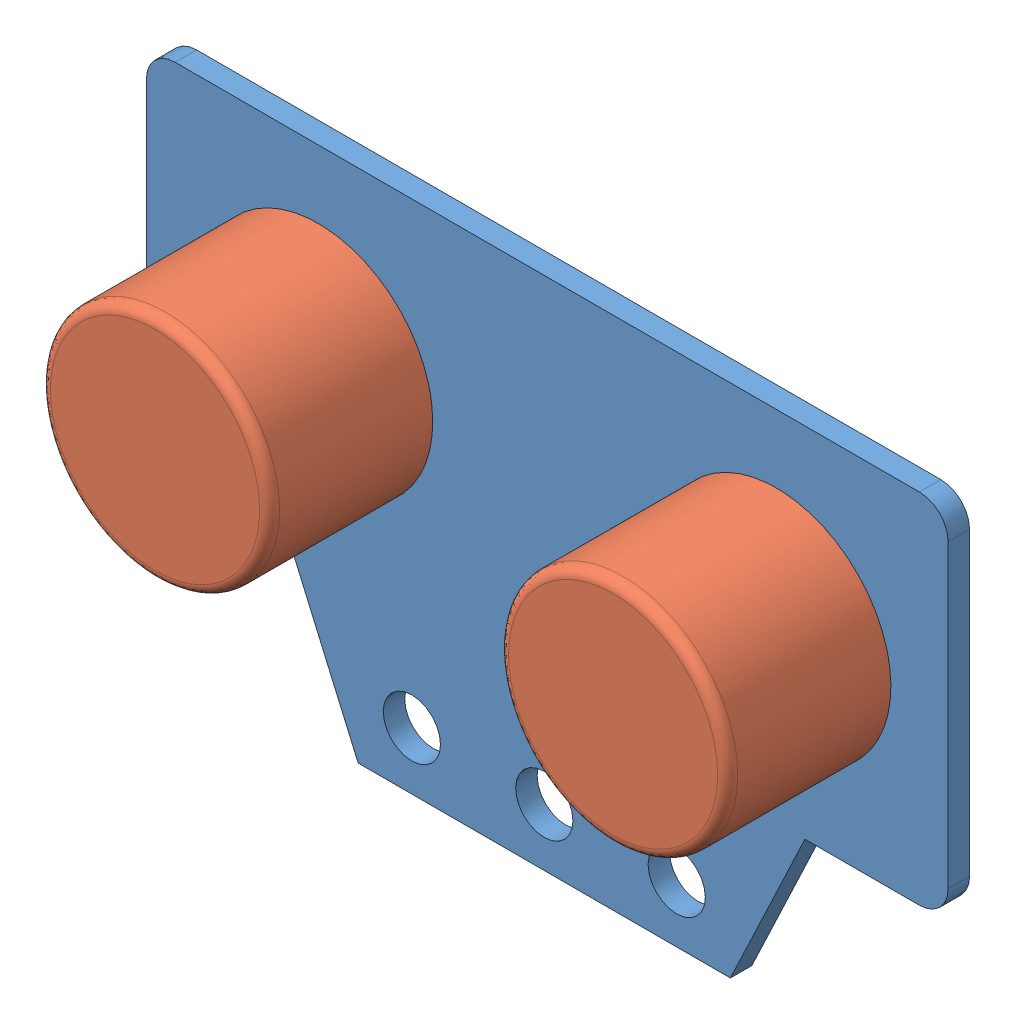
SolidWorks assembly Assemblage2.sldasm, configuration Défaut (file format 5000). Lengths in mm.
Overall size (56 36 12.9).
3 component instances, 2 part files, 4 mates.
Components (placement in the parent):
- CarteUltraSon-1: CarteUltraSon.SLDPRT [Défaut] at (-26.9365 -6.5802 -0.75) size (56 36 1.5)
- UltraSon-1: UltraSon.SLDPRT [Défaut] at (-14.9365 5.6707 12.15) x (-0.923728 -0.383049 0) z (0 0 -1) size (16 16 12.4)
- UltraSon-2: UltraSon.SLDPRT [Défaut] at (17.0635 5.6707 12.15) x (-0.923728 -0.383049 0) z (0 0 -1) size (16 16 12.4)
Mates (geometry in assembly coordinates):
- Coaxiale1: concentric: cylinder of CarteUltraSon-1 through (-14.9365 5.6707 0.75) axis (0 0 1) radius 8; cylinder of UltraSon-1 through (-14.9365 5.6707 -0.25) axis (0 0 1) radius 6.6
- Coïncidente1: coincident anti-aligned: plane of CarteUltraSon-1 through (-14.9365 5.6707 -0.25) normal (0 0 1); plane of UltraSon-1 through (-22.3263 2.6063 -0.25) normal (0 0 -1)
- Coaxiale2: concentric: cylinder of CarteUltraSon-1 through (17.0635 5.6707 0.75) axis (0 0 1) radius 8; cylinder of UltraSon-2 through (17.0635 5.6707 -0.25) axis (0 0 1) radius 6.6
- Coïncidente2: coincident anti-aligned: plane of CarteUltraSon-1 through (17.0635 5.6707 -0.25) normal (0 0 1); plane of UltraSon-2 through (9.6737 2.6063 -0.25) normal (0 0 -1)
